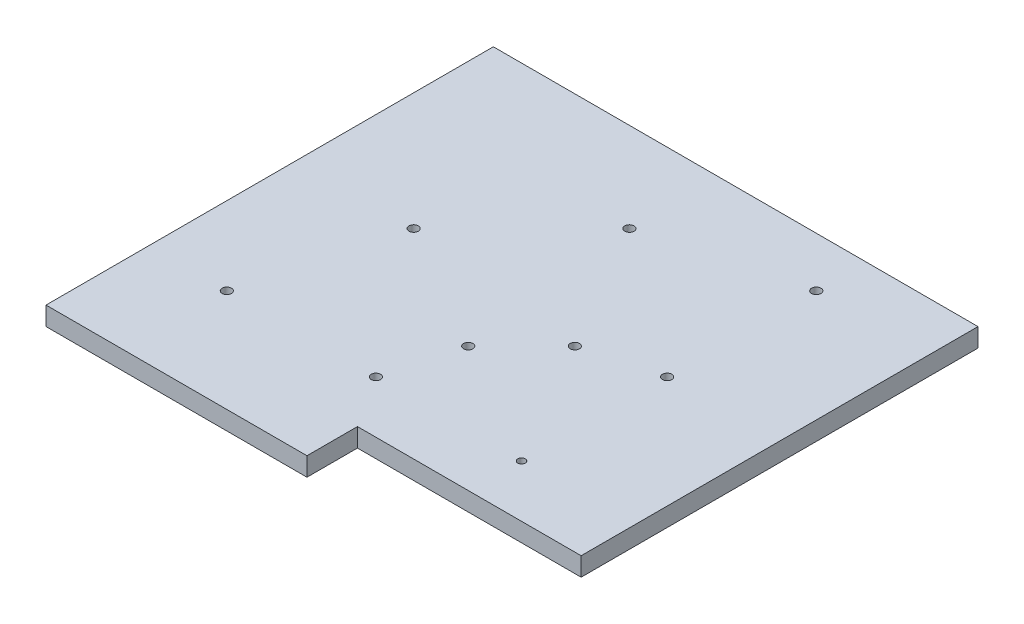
from build123d import *

# Parameters (mm, degrees)
SKETCH1_W                            = 330.2
SKETCH1_H                            = 304.8
BOSS_EXTRUDE1_DEPTH                  = 12.7
SKETCH2_W                            = 152.4
SKETCH2_H                            = 34.4
CUT_EXTRUDE1_DEPTH                   = 12.7
F_7_0_201_DIAMETER_HOLE1_D           = 5.1054
F_7_0_201_DIAMETER_HOLE1_DEPTH       = 50.8
F_7_0_201_DIAMETER_HOLE1_TIP         = 1.533816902
F_1_4_0_25_DIAMETER_HOLE1_AT_2_COUNT = 2
F_1_4_0_25_DIAMETER_HOLE1_AT_2_PITCH = 101.6
CIRPATTERN1_COUNT                    = 4
CIRPATTERN1_ANGLE                    = 90


with BuildPart() as part:
    # Sketch1 → Boss-Extrude1 (new body)
    with BuildSketch(Plane(origin=(0, 0, 0), x_dir=(1, 0, 0), z_dir=(0, 1, 0))):
        with Locations((165.1, 152.4)):
            Rectangle(SKETCH1_W, SKETCH1_H)
    extrude(amount=BOSS_EXTRUDE1_DEPTH)

    # Sketch2 → Cut-Extrude1 (cut)
    with BuildSketch(Plane(origin=(0, 12.7, 0), x_dir=(1, 0, 0), z_dir=(0, 1, 0))):
        with Locations((254, 17.2)):
            Rectangle(SKETCH2_W, SKETCH2_H)
    extrude(amount=-CUT_EXTRUDE1_DEPTH, mode=Mode.SUBTRACT)

    # 7 _0.201_ Diameter Hole1
    with Locations(Plane(origin=(0, 12.7, 0), x_dir=(1, 0, 0), z_dir=(0, 1, 0))):
        with Locations((254, 70)):
            Hole(F_7_0_201_DIAMETER_HOLE1_D / 2, depth=F_7_0_201_DIAMETER_HOLE1_DEPTH)
            with Locations((0, 0, -(F_7_0_201_DIAMETER_HOLE1_DEPTH + F_7_0_201_DIAMETER_HOLE1_TIP / 2))):  # 118° drill point
                Cone(0, F_7_0_201_DIAMETER_HOLE1_D / 2, F_7_0_201_DIAMETER_HOLE1_TIP, mode=Mode.SUBTRACT)

    # Sketch5 → 1_4 _0.25_ Diameter Hole1 (revolve, cut)
    with BuildSketch(Plane(origin=(254, 12.7, -169.2), x_dir=(0, 0, 1), z_dir=(1, 0, 0))):
        Polygon((0, 0), (0, 52.707732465), (3.175, 50.8), (3.175, 0), align=None)
    f_1_4_0_25_diameter_hole1 = revolve(axis=Axis((254, 19.05, -169.2), (0, -1, 0)), mode=Mode.SUBTRACT)

    # 1_4 _0.25_ Diameter Hole1 at 2: 1_4 _0.25_ Diameter Hole1 ×2
    with Locations(*[(0, 0, -i * F_1_4_0_25_DIAMETER_HOLE1_AT_2_PITCH) for i in range(1, F_1_4_0_25_DIAMETER_HOLE1_AT_2_COUNT)]):
        add(f_1_4_0_25_diameter_hole1, mode=Mode.SUBTRACT)

    # CirPattern1: 1_4 _0.25_ Diameter Hole1 ×4 about axis
    cirpattern1_axis = Axis((254, 0, -70), (0, 1, 0))
    for i in range(1, CIRPATTERN1_COUNT):
        add(f_1_4_0_25_diameter_hole1.rotate(cirpattern1_axis, i * CIRPATTERN1_ANGLE / (CIRPATTERN1_COUNT - 1)), mode=Mode.SUBTRACT)

    # CirPattern1 copy 1 sketch → CirPattern1 copy 1 (revolve, cut)
    with BuildSketch(Plane(origin=(153.6, 12.7, -243.89790108), x_dir=(0.500000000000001, 0, 0.866025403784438), z_dir=(0.866025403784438, 0, -0.500000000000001))):
        Polygon((0, 0), (0, 52.707732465), (3.175, 50.8), (3.175, 0), align=None)
    revolve(axis=Axis((153.6, 19.05, -243.89790108), (0, -1, 0)), mode=Mode.SUBTRACT)

    # CirPattern1 copy 2 sketch → CirPattern1 copy 2 (revolve, cut)
    with BuildSketch(Plane(origin=(80.10209892, 12.7, -170.4), x_dir=(0.8660254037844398, 0, 0.499999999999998), z_dir=(0.499999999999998, 0, -0.8660254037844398))):
        Polygon((0, 0), (0, 52.707732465), (3.175, 50.8), (3.175, 0), align=None)
    revolve(axis=Axis((80.10209892, 19.05, -170.4), (0, -1, 0)), mode=Mode.SUBTRACT)

    # CirPattern1 copy 3 sketch → CirPattern1 copy 3 (revolve, cut)
    with BuildSketch(Plane(origin=(53.2, 12.7, -70), x_dir=(1, 0, 0), z_dir=(0, 0, -1))):
        Polygon((0, 0), (0, 52.707732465), (3.175, 50.8), (3.175, 0), align=None)
    revolve(axis=Axis((53.2, 19.05, -70), (0, -1, 0)), mode=Mode.SUBTRACT)


solid = part.part
